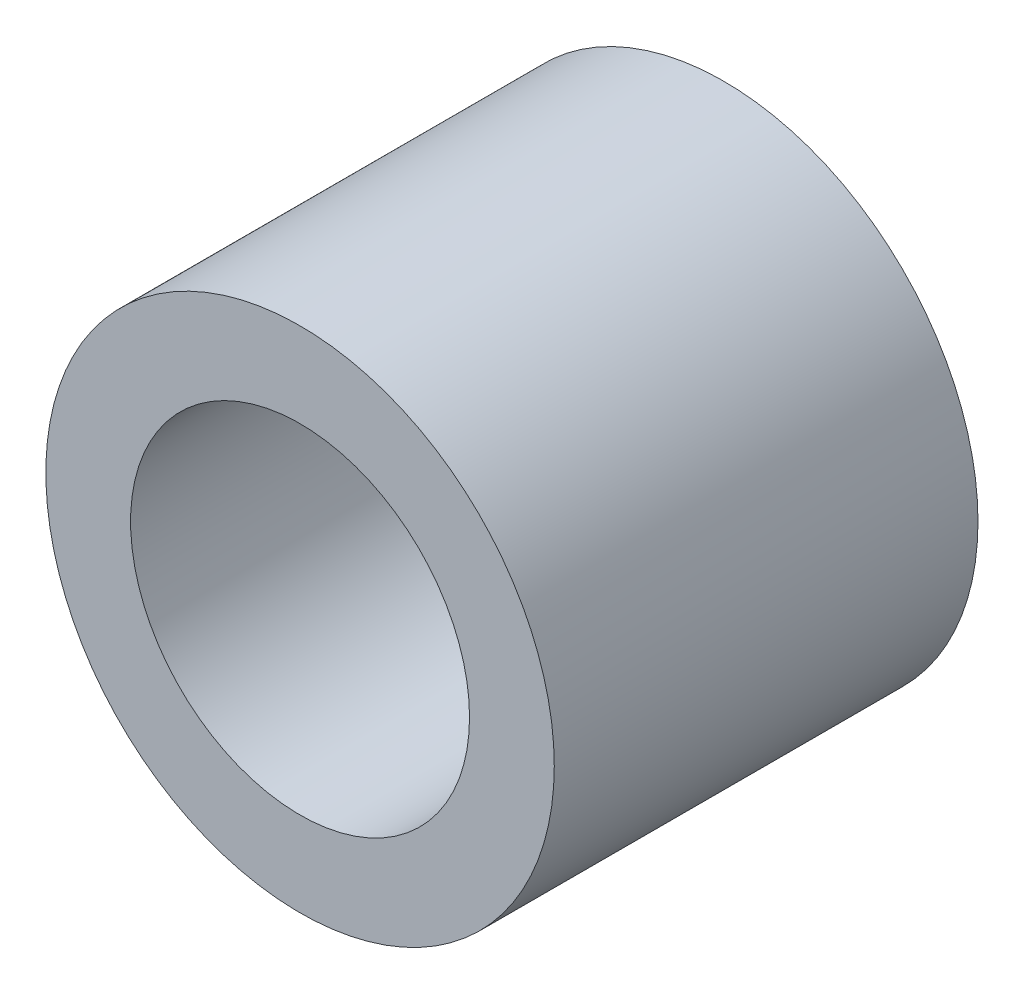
from build123d import *

# Parameters (mm, degrees)
ESQUISSE3_R             = 3
BOSS_EXTRU_2_DEPTH      = 5
ESQUISSE4_R             = 2
ENL_V_MAT_EXTRU_1_DEPTH = 7.557438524


with BuildPart() as part:
    # Esquisse3 → Boss.-Extru.2 (new body)
    with BuildSketch(Plane.XY.offset(7)):
        Circle(ESQUISSE3_R)
    extrude(amount=-BOSS_EXTRU_2_DEPTH)

    # Esquisse4 → Enl_v. mat.-Extru.1 (cut, through all)
    with BuildSketch(Plane.XY.offset(7)):
        Circle(ESQUISSE4_R)
    extrude(amount=-ENL_V_MAT_EXTRU_1_DEPTH, mode=Mode.SUBTRACT)


solid = part.part
